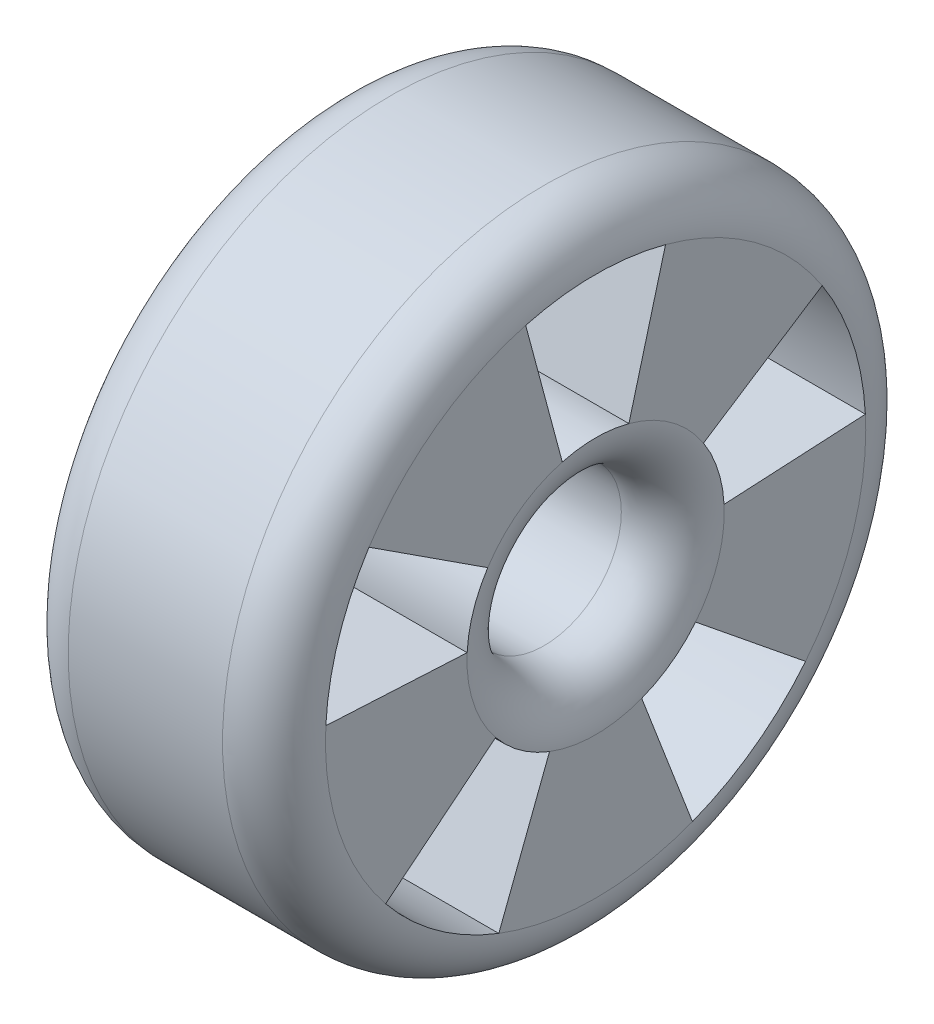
ISO-10303-21;
HEADER;
FILE_DESCRIPTION(('STEP AP214'),'2;1');
FILE_NAME('part.step','',(''),(''),'','','');
FILE_SCHEMA(('AUTOMOTIVE_DESIGN { 1 0 10303 214 1 1 1 1 }'));
ENDSEC;
DATA;
#1=APPLICATION_CONTEXT('core data for automotive mechanical design processes');
#2=APPLICATION_PROTOCOL_DEFINITION('international standard','automotive_design',2000,#1);
#3=PRODUCT_CONTEXT('',#1,'mechanical');
#4=PRODUCT('Part','Part','',(#3));
#5=PRODUCT_RELATED_PRODUCT_CATEGORY('part','',(#4));
#6=PRODUCT_DEFINITION_FORMATION('','',#4);
#7=PRODUCT_DEFINITION_CONTEXT('part definition',#1,'design');
#8=PRODUCT_DEFINITION('design','',#6,#7);
#9=PRODUCT_DEFINITION_SHAPE('','',#8);
#10=(LENGTH_UNIT() NAMED_UNIT(*) SI_UNIT(.MILLI.,.METRE.));
#11=(NAMED_UNIT(*) PLANE_ANGLE_UNIT() SI_UNIT($,.RADIAN.));
#12=(NAMED_UNIT(*) SI_UNIT($,.STERADIAN.) SOLID_ANGLE_UNIT());
#13=UNCERTAINTY_MEASURE_WITH_UNIT(LENGTH_MEASURE(1.E-05),#10,'distance_accuracy_value','');
#14=(GEOMETRIC_REPRESENTATION_CONTEXT(3) GLOBAL_UNCERTAINTY_ASSIGNED_CONTEXT((#13)) GLOBAL_UNIT_ASSIGNED_CONTEXT((#10,
#11,#12)) REPRESENTATION_CONTEXT('',''));
#15=CARTESIAN_POINT('',(0.,0.,0.));
#16=DIRECTION('',(0.,0.,1.));
#17=DIRECTION('',(1.,0.,0.));
#18=AXIS2_PLACEMENT_3D('',#15,#16,#17);
#19=CARTESIAN_POINT('',(10.,0.,0.));
#20=DIRECTION('',(1.,0.,0.));
#21=DIRECTION('',(0.,0.,-1.));
#22=AXIS2_PLACEMENT_3D('',#19,#20,#21);
#23=PLANE('',#22);
#24=DIRECTION('',(0.,-0.544639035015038,0.838670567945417));
#25=VECTOR('',#24,1.);
#26=CARTESIAN_POINT('',(10.,5.71870986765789,-8.80604096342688));
#27=LINE('',#26,#25);
#28=CARTESIAN_POINT('',(10.,5.71870986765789,-8.80604096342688));
#29=VERTEX_POINT('',#28);
#30=CARTESIAN_POINT('',(10.,2.72319517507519,-4.19335283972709));
#31=VERTEX_POINT('',#30);
#32=EDGE_CURVE('E196',#29,#31,#27,.T.);
#33=ORIENTED_EDGE('',*,*,#32,.F.);
#34=CARTESIAN_POINT('',(10.,0.,0.));
#35=DIRECTION('',(1.,0.,0.));
#36=DIRECTION('',(0.,0.,-1.));
#37=AXIS2_PLACEMENT_3D('',#34,#35,#36);
#38=CIRCLE('',#37,10.5);
#39=CARTESIAN_POINT('',(10.,10.1422211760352,-2.71759997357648));
#40=VERTEX_POINT('',#39);
#41=EDGE_CURVE('E219',#29,#40,#38,.T.);
#42=ORIENTED_EDGE('',*,*,#41,.T.);
#43=DIRECTION('',(0.,0.965925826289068,-0.258819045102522));
#44=VECTOR('',#43,1.);
#45=CARTESIAN_POINT('',(10.,10.1422211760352,-2.71759997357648));
#46=LINE('',#45,#44);
#47=CARTESIAN_POINT('',(10.,4.82962913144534,-1.29409522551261));
#48=VERTEX_POINT('',#47);
#49=EDGE_CURVE('E263',#48,#40,#46,.T.);
#50=ORIENTED_EDGE('',*,*,#49,.F.);
#51=CARTESIAN_POINT('',(10.,0.,0.));
#52=DIRECTION('',(1.,0.,0.));
#53=DIRECTION('',(0.,0.,-1.));
#54=AXIS2_PLACEMENT_3D('',#51,#52,#53);
#55=CIRCLE('',#54,5.);
#56=EDGE_CURVE('E227',#48,#31,#55,.F.);
#57=ORIENTED_EDGE('',*,*,#56,.T.);
#58=EDGE_LOOP('',(#33,#42,#50,#57));
#59=FACE_BOUND('',#58,.T.);
#60=ADVANCED_FACE('F33',(#59),#23,.T.);
#61=CARTESIAN_POINT('',(0.,0.,0.));
#62=DIRECTION('',(1.,0.,0.));
#63=DIRECTION('',(0.,0.,-1.));
#64=AXIS2_PLACEMENT_3D('',#61,#62,#63);
#65=PLANE('',#64);
#66=CARTESIAN_POINT('',(0.,0.,0.));
#67=DIRECTION('',(1.,0.,0.));
#68=DIRECTION('',(0.,0.,-1.));
#69=AXIS2_PLACEMENT_3D('',#66,#67,#68);
#70=CIRCLE('',#69,10.5);
#71=CARTESIAN_POINT('',(0.,10.1422211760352,-2.71759997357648));
#72=VERTEX_POINT('',#71);
#73=CARTESIAN_POINT('',(0.,5.71870986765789,-8.80604096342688));
#74=VERTEX_POINT('',#73);
#75=EDGE_CURVE('E400',#72,#74,#70,.F.);
#76=ORIENTED_EDGE('',*,*,#75,.T.);
#77=DIRECTION('',(0.,-0.544639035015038,0.838670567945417));
#78=VECTOR('',#77,1.);
#79=CARTESIAN_POINT('',(0.,5.71870986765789,-8.80604096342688));
#80=LINE('',#79,#78);
#81=CARTESIAN_POINT('',(0.,2.72319517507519,-4.19335283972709));
#82=VERTEX_POINT('',#81);
#83=EDGE_CURVE('E48',#74,#82,#80,.T.);
#84=ORIENTED_EDGE('',*,*,#83,.T.);
#85=CARTESIAN_POINT('',(0.,0.,0.));
#86=DIRECTION('',(1.,0.,0.));
#87=DIRECTION('',(0.,0.,-1.));
#88=AXIS2_PLACEMENT_3D('',#85,#86,#87);
#89=CIRCLE('',#88,5.);
#90=CARTESIAN_POINT('',(0.,4.82962913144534,-1.29409522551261));
#91=VERTEX_POINT('',#90);
#92=EDGE_CURVE('E195',#82,#91,#89,.T.);
#93=ORIENTED_EDGE('',*,*,#92,.T.);
#94=DIRECTION('',(0.,0.965925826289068,-0.258819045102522));
#95=VECTOR('',#94,1.);
#96=CARTESIAN_POINT('',(0.,10.1422211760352,-2.71759997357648));
#97=LINE('',#96,#95);
#98=EDGE_CURVE('E262',#91,#72,#97,.T.);
#99=ORIENTED_EDGE('',*,*,#98,.T.);
#100=EDGE_LOOP('',(#76,#84,#93,#99));
#101=FACE_BOUND('',#100,.T.);
#102=ADVANCED_FACE('F404',(#101),#65,.F.);
#103=DIRECTION('',(0.,0.052335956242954,-0.998629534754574));
#104=VECTOR('',#103,1.);
#105=CARTESIAN_POINT('',(10.,0.549527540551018,-10.485610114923));
#106=LINE('',#105,#104);
#107=CARTESIAN_POINT('',(10.,0.261679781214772,-4.99314767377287));
#108=VERTEX_POINT('',#107);
#109=CARTESIAN_POINT('',(10.,0.549527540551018,-10.485610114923));
#110=VERTEX_POINT('',#109);
#111=EDGE_CURVE('E56',#108,#110,#106,.T.);
#112=ORIENTED_EDGE('',*,*,#111,.F.);
#113=CARTESIAN_POINT('',(10.,-3.14660195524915,-3.88572980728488));
#114=VERTEX_POINT('',#113);
#115=EDGE_CURVE('E228',#108,#114,#55,.F.);
#116=ORIENTED_EDGE('',*,*,#115,.T.);
#117=DIRECTION('',(0.,0.62932039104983,0.777145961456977));
#118=VECTOR('',#117,1.);
#119=CARTESIAN_POINT('',(10.,-6.60786410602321,-8.16003259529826));
#120=LINE('',#119,#118);
#121=CARTESIAN_POINT('',(10.,-6.60786410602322,-8.16003259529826));
#122=VERTEX_POINT('',#121);
#123=EDGE_CURVE('E362',#122,#114,#120,.T.);
#124=ORIENTED_EDGE('',*,*,#123,.F.);
#125=EDGE_CURVE('E488',#122,#110,#38,.T.);
#126=ORIENTED_EDGE('',*,*,#125,.T.);
#127=EDGE_LOOP('',(#112,#116,#124,#126));
#128=FACE_BOUND('',#127,.T.);
#129=ADVANCED_FACE('F487',(#128),#23,.T.);
#130=CARTESIAN_POINT('',(0.,-3.14660195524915,-3.88572980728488));
#131=VERTEX_POINT('',#130);
#132=CARTESIAN_POINT('',(0.,0.261679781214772,-4.99314767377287));
#133=VERTEX_POINT('',#132);
#134=EDGE_CURVE('E194',#131,#133,#89,.T.);
#135=ORIENTED_EDGE('',*,*,#134,.T.);
#136=DIRECTION('',(0.,0.052335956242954,-0.998629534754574));
#137=VECTOR('',#136,1.);
#138=CARTESIAN_POINT('',(0.,0.549527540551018,-10.485610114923));
#139=LINE('',#138,#137);
#140=CARTESIAN_POINT('',(0.,0.549527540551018,-10.485610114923));
#141=VERTEX_POINT('',#140);
#142=EDGE_CURVE('E180',#133,#141,#139,.T.);
#143=ORIENTED_EDGE('',*,*,#142,.T.);
#144=CARTESIAN_POINT('',(0.,-6.60786410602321,-8.16003259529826));
#145=VERTEX_POINT('',#144);
#146=EDGE_CURVE('E401',#141,#145,#70,.F.);
#147=ORIENTED_EDGE('',*,*,#146,.T.);
#148=DIRECTION('',(0.,0.62932039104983,0.777145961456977));
#149=VECTOR('',#148,1.);
#150=CARTESIAN_POINT('',(0.,-6.60786410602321,-8.16003259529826));
#151=LINE('',#150,#149);
#152=EDGE_CURVE('E201',#145,#131,#151,.T.);
#153=ORIENTED_EDGE('',*,*,#152,.T.);
#154=EDGE_LOOP('',(#135,#143,#147,#153));
#155=FACE_BOUND('',#154,.T.);
#156=ADVANCED_FACE('F199',(#155),#65,.F.);
#157=DIRECTION('',(0.,-0.933580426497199,-0.358367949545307));
#158=VECTOR('',#157,1.);
#159=CARTESIAN_POINT('',(10.,-9.80259447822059,-3.76286347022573));
#160=LINE('',#159,#158);
#161=CARTESIAN_POINT('',(10.,-4.667902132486,-1.79183974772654));
#162=VERTEX_POINT('',#161);
#163=CARTESIAN_POINT('',(10.,-9.80259447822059,-3.76286347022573));
#164=VERTEX_POINT('',#163);
#165=EDGE_CURVE('E369',#162,#164,#160,.T.);
#166=ORIENTED_EDGE('',*,*,#165,.F.);
#167=CARTESIAN_POINT('',(10.,-4.66790213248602,1.79183974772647));
#168=VERTEX_POINT('',#167);
#169=EDGE_CURVE('E454',#162,#168,#55,.F.);
#170=ORIENTED_EDGE('',*,*,#169,.T.);
#171=DIRECTION('',(0.,0.933580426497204,-0.358367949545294));
#172=VECTOR('',#171,1.);
#173=CARTESIAN_POINT('',(10.,-9.80259447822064,3.76286347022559));
#174=LINE('',#173,#172);
#175=CARTESIAN_POINT('',(10.,-9.80259447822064,3.76286347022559));
#176=VERTEX_POINT('',#175);
#177=EDGE_CURVE('E330',#176,#168,#174,.T.);
#178=ORIENTED_EDGE('',*,*,#177,.F.);
#179=EDGE_CURVE('E489',#176,#164,#38,.T.);
#180=ORIENTED_EDGE('',*,*,#179,.T.);
#181=EDGE_LOOP('',(#166,#170,#178,#180));
#182=FACE_BOUND('',#181,.T.);
#183=ADVANCED_FACE('F465',(#182),#23,.T.);
#184=CARTESIAN_POINT('',(0.,-4.66790213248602,1.79183974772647));
#185=VERTEX_POINT('',#184);
#186=CARTESIAN_POINT('',(0.,-4.667902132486,-1.79183974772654));
#187=VERTEX_POINT('',#186);
#188=EDGE_CURVE('E202',#185,#187,#89,.T.);
#189=ORIENTED_EDGE('',*,*,#188,.T.);
#190=DIRECTION('',(0.,-0.933580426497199,-0.358367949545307));
#191=VECTOR('',#190,1.);
#192=CARTESIAN_POINT('',(0.,-9.80259447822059,-3.76286347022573));
#193=LINE('',#192,#191);
#194=CARTESIAN_POINT('',(0.,-9.80259447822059,-3.76286347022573));
#195=VERTEX_POINT('',#194);
#196=EDGE_CURVE('E379',#187,#195,#193,.T.);
#197=ORIENTED_EDGE('',*,*,#196,.T.);
#198=CARTESIAN_POINT('',(0.,-9.80259447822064,3.76286347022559));
#199=VERTEX_POINT('',#198);
#200=EDGE_CURVE('E405',#195,#199,#70,.F.);
#201=ORIENTED_EDGE('',*,*,#200,.T.);
#202=DIRECTION('',(0.,0.933580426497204,-0.358367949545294));
#203=VECTOR('',#202,1.);
#204=CARTESIAN_POINT('',(0.,-9.80259447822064,3.76286347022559));
#205=LINE('',#204,#203);
#206=EDGE_CURVE('E323',#199,#185,#205,.T.);
#207=ORIENTED_EDGE('',*,*,#206,.T.);
#208=EDGE_LOOP('',(#189,#197,#201,#207));
#209=FACE_BOUND('',#208,.T.);
#210=ADVANCED_FACE('F414',(#209),#65,.F.);
#211=DIRECTION('',(0.,-0.629320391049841,0.777145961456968));
#212=VECTOR('',#211,1.);
#213=CARTESIAN_POINT('',(10.,-6.60786410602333,8.16003259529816));
#214=LINE('',#213,#212);
#215=CARTESIAN_POINT('',(10.,-3.14660195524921,3.88572980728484));
#216=VERTEX_POINT('',#215);
#217=CARTESIAN_POINT('',(10.,-6.60786410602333,8.16003259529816));
#218=VERTEX_POINT('',#217);
#219=EDGE_CURVE('E337',#216,#218,#214,.T.);
#220=ORIENTED_EDGE('',*,*,#219,.F.);
#221=CARTESIAN_POINT('',(10.,0.261679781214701,4.99314767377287));
#222=VERTEX_POINT('',#221);
#223=EDGE_CURVE('E452',#216,#222,#55,.F.);
#224=ORIENTED_EDGE('',*,*,#223,.T.);
#225=DIRECTION('',(0.,-0.0523359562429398,-0.998629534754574));
#226=VECTOR('',#225,1.);
#227=CARTESIAN_POINT('',(10.,0.54952754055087,10.485610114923));
#228=LINE('',#227,#226);
#229=CARTESIAN_POINT('',(10.,0.549527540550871,10.485610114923));
#230=VERTEX_POINT('',#229);
#231=EDGE_CURVE('E297',#230,#222,#228,.T.);
#232=ORIENTED_EDGE('',*,*,#231,.F.);
#233=EDGE_CURVE('E490',#230,#218,#38,.T.);
#234=ORIENTED_EDGE('',*,*,#233,.T.);
#235=EDGE_LOOP('',(#220,#224,#232,#234));
#236=FACE_BOUND('',#235,.T.);
#237=ADVANCED_FACE('F512',(#236),#23,.T.);
#238=CARTESIAN_POINT('',(0.,0.261679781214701,4.99314767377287));
#239=VERTEX_POINT('',#238);
#240=CARTESIAN_POINT('',(0.,-3.14660195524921,3.88572980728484));
#241=VERTEX_POINT('',#240);
#242=EDGE_CURVE('E205',#239,#241,#89,.T.);
#243=ORIENTED_EDGE('',*,*,#242,.T.);
#244=DIRECTION('',(0.,-0.629320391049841,0.777145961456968));
#245=VECTOR('',#244,1.);
#246=CARTESIAN_POINT('',(0.,-6.60786410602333,8.16003259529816));
#247=LINE('',#246,#245);
#248=CARTESIAN_POINT('',(0.,-6.60786410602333,8.16003259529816));
#249=VERTEX_POINT('',#248);
#250=EDGE_CURVE('E348',#241,#249,#247,.T.);
#251=ORIENTED_EDGE('',*,*,#250,.T.);
#252=CARTESIAN_POINT('',(0.,0.54952754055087,10.485610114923));
#253=VERTEX_POINT('',#252);
#254=EDGE_CURVE('E406',#249,#253,#70,.F.);
#255=ORIENTED_EDGE('',*,*,#254,.T.);
#256=DIRECTION('',(0.,-0.0523359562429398,-0.998629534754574));
#257=VECTOR('',#256,1.);
#258=CARTESIAN_POINT('',(0.,0.54952754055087,10.485610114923));
#259=LINE('',#258,#257);
#260=EDGE_CURVE('E290',#253,#239,#259,.T.);
#261=ORIENTED_EDGE('',*,*,#260,.T.);
#262=EDGE_LOOP('',(#243,#251,#255,#261));
#263=FACE_BOUND('',#262,.T.);
#264=ADVANCED_FACE('F439',(#263),#65,.F.);
#265=DIRECTION('',(0.,0.544639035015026,0.838670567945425));
#266=VECTOR('',#265,1.);
#267=CARTESIAN_POINT('',(10.,5.71870986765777,8.80604096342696));
#268=LINE('',#267,#266);
#269=CARTESIAN_POINT('',(10.,2.72319517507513,4.19335283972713));
#270=VERTEX_POINT('',#269);
#271=CARTESIAN_POINT('',(10.,5.71870986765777,8.80604096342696));
#272=VERTEX_POINT('',#271);
#273=EDGE_CURVE('E304',#270,#272,#268,.T.);
#274=ORIENTED_EDGE('',*,*,#273,.F.);
#275=CARTESIAN_POINT('',(10.,4.82962913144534,1.29409522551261));
#276=VERTEX_POINT('',#275);
#277=EDGE_CURVE('E223',#270,#276,#55,.F.);
#278=ORIENTED_EDGE('',*,*,#277,.T.);
#279=DIRECTION('',(0.,-0.965925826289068,-0.258819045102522));
#280=VECTOR('',#279,1.);
#281=CARTESIAN_POINT('',(10.,10.1422211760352,2.71759997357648));
#282=LINE('',#281,#280);
#283=CARTESIAN_POINT('',(10.,10.1422211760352,2.71759997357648));
#284=VERTEX_POINT('',#283);
#285=EDGE_CURVE('E255',#284,#276,#282,.T.);
#286=ORIENTED_EDGE('',*,*,#285,.F.);
#287=EDGE_CURVE('E224',#284,#272,#38,.T.);
#288=ORIENTED_EDGE('',*,*,#287,.T.);
#289=EDGE_LOOP('',(#274,#278,#286,#288));
#290=FACE_BOUND('',#289,.T.);
#291=ADVANCED_FACE('F257',(#290),#23,.T.);
#292=CARTESIAN_POINT('',(0.,4.82962913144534,1.29409522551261));
#293=VERTEX_POINT('',#292);
#294=CARTESIAN_POINT('',(0.,2.72319517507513,4.19335283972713));
#295=VERTEX_POINT('',#294);
#296=EDGE_CURVE('E212',#293,#295,#89,.T.);
#297=ORIENTED_EDGE('',*,*,#296,.T.);
#298=DIRECTION('',(0.,0.544639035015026,0.838670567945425));
#299=VECTOR('',#298,1.);
#300=CARTESIAN_POINT('',(0.,5.71870986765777,8.80604096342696));
#301=LINE('',#300,#299);
#302=CARTESIAN_POINT('',(0.,5.71870986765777,8.80604096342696));
#303=VERTEX_POINT('',#302);
#304=EDGE_CURVE('E315',#295,#303,#301,.T.);
#305=ORIENTED_EDGE('',*,*,#304,.T.);
#306=CARTESIAN_POINT('',(0.,10.1422211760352,2.71759997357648));
#307=VERTEX_POINT('',#306);
#308=EDGE_CURVE('E275',#303,#307,#70,.F.);
#309=ORIENTED_EDGE('',*,*,#308,.T.);
#310=DIRECTION('',(0.,-0.965925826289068,-0.258819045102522));
#311=VECTOR('',#310,1.);
#312=CARTESIAN_POINT('',(0.,10.1422211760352,2.71759997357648));
#313=LINE('',#312,#311);
#314=EDGE_CURVE('E266',#307,#293,#313,.T.);
#315=ORIENTED_EDGE('',*,*,#314,.T.);
#316=EDGE_LOOP('',(#297,#305,#309,#315));
#317=FACE_BOUND('',#316,.T.);
#318=ADVANCED_FACE('F431',(#317),#65,.F.);
#319=CARTESIAN_POINT('',(10.,0.,0.));
#320=DIRECTION('',(-1.,0.,0.));
#321=DIRECTION('',(0.,0.,1.));
#322=AXIS2_PLACEMENT_3D('',#319,#320,#321);
#323=CYLINDRICAL_SURFACE('',#322,12.5);
#324=CARTESIAN_POINT('',(2.,0.,0.));
#325=DIRECTION('',(1.,0.,0.));
#326=DIRECTION('',(0.,0.,-1.));
#327=AXIS2_PLACEMENT_3D('',#324,#325,#326);
#328=CIRCLE('',#327,12.5);
#329=CARTESIAN_POINT('',(2.,0.,-12.5));
#330=VERTEX_POINT('',#329);
#331=EDGE_CURVE('E11',#330,#330,#328,.T.);
#332=ORIENTED_EDGE('',*,*,#331,.T.);
#333=EDGE_LOOP('',(#332));
#334=FACE_BOUND('',#333,.T.);
#335=CARTESIAN_POINT('',(8.,0.,0.));
#336=DIRECTION('',(1.,0.,0.));
#337=DIRECTION('',(0.,0.,-1.));
#338=AXIS2_PLACEMENT_3D('',#335,#336,#337);
#339=CIRCLE('',#338,12.5);
#340=CARTESIAN_POINT('',(8.,0.,-12.5));
#341=VERTEX_POINT('',#340);
#342=EDGE_CURVE('E41',#341,#341,#339,.F.);
#343=ORIENTED_EDGE('',*,*,#342,.T.);
#344=EDGE_LOOP('',(#343));
#345=FACE_BOUND('',#344,.T.);
#346=ADVANCED_FACE('F232',(#334,#345),#323,.T.);
#347=CARTESIAN_POINT('',(10.,0.,0.));
#348=DIRECTION('',(-1.,0.,0.));
#349=DIRECTION('',(0.,0.,1.));
#350=AXIS2_PLACEMENT_3D('',#347,#348,#349);
#351=CYLINDRICAL_SURFACE('',#350,3.);
#352=CARTESIAN_POINT('',(2.,0.,0.));
#353=DIRECTION('',(1.,0.,0.));
#354=DIRECTION('',(0.,0.,-1.));
#355=AXIS2_PLACEMENT_3D('',#352,#353,#354);
#356=CIRCLE('',#355,3.);
#357=CARTESIAN_POINT('',(2.,0.,-3.));
#358=VERTEX_POINT('',#357);
#359=EDGE_CURVE('E216',#358,#358,#356,.F.);
#360=ORIENTED_EDGE('',*,*,#359,.T.);
#361=EDGE_LOOP('',(#360));
#362=FACE_BOUND('',#361,.T.);
#363=CARTESIAN_POINT('',(8.,0.,0.));
#364=DIRECTION('',(1.,0.,0.));
#365=DIRECTION('',(0.,0.,-1.));
#366=AXIS2_PLACEMENT_3D('',#363,#364,#365);
#367=CIRCLE('',#366,3.);
#368=CARTESIAN_POINT('',(8.,0.,-3.));
#369=VERTEX_POINT('',#368);
#370=EDGE_CURVE('E211',#369,#369,#367,.T.);
#371=ORIENTED_EDGE('',*,*,#370,.T.);
#372=EDGE_LOOP('',(#371));
#373=FACE_BOUND('',#372,.T.);
#374=ADVANCED_FACE('F530',(#362,#373),#351,.F.);
#375=CARTESIAN_POINT('',(2.,0.,0.));
#376=DIRECTION('',(1.,0.,0.));
#377=DIRECTION('',(0.,0.,-1.));
#378=AXIS2_PLACEMENT_3D('',#375,#376,#377);
#379=TOROIDAL_SURFACE('',#378,5.,2.);
#380=ORIENTED_EDGE('',*,*,#359,.F.);
#381=EDGE_LOOP('',(#380));
#382=FACE_BOUND('',#381,.T.);
#383=EDGE_CURVE('E207',#91,#293,#89,.T.);
#384=ORIENTED_EDGE('',*,*,#383,.F.);
#385=ORIENTED_EDGE('',*,*,#92,.F.);
#386=CARTESIAN_POINT('',(0.,0.,0.));
#387=DIRECTION('',(-1.,0.,0.));
#388=DIRECTION('',(0.,-0.95105651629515,-0.309016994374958));
#389=AXIS2_PLACEMENT_3D('',#386,#387,#388);
#390=CIRCLE('',#389,5.);
#391=EDGE_CURVE('E174',#82,#133,#390,.T.);
#392=ORIENTED_EDGE('',*,*,#391,.T.);
#393=ORIENTED_EDGE('',*,*,#134,.F.);
#394=CARTESIAN_POINT('',(0.,0.,0.));
#395=DIRECTION('',(-1.,0.,0.));
#396=DIRECTION('',(0.,-0.58778525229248,0.809016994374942));
#397=AXIS2_PLACEMENT_3D('',#394,#395,#396);
#398=CIRCLE('',#397,5.);
#399=EDGE_CURVE('E365',#131,#187,#398,.T.);
#400=ORIENTED_EDGE('',*,*,#399,.T.);
#401=ORIENTED_EDGE('',*,*,#188,.F.);
#402=CARTESIAN_POINT('',(0.,0.,0.));
#403=DIRECTION('',(-1.,0.,0.));
#404=DIRECTION('',(0.,0.587785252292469,0.809016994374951));
#405=AXIS2_PLACEMENT_3D('',#402,#403,#404);
#406=CIRCLE('',#405,5.);
#407=EDGE_CURVE('E333',#185,#241,#406,.T.);
#408=ORIENTED_EDGE('',*,*,#407,.T.);
#409=ORIENTED_EDGE('',*,*,#242,.F.);
#410=CARTESIAN_POINT('',(0.,0.,0.));
#411=DIRECTION('',(-1.,0.,0.));
#412=DIRECTION('',(0.,0.951056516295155,-0.309016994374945));
#413=AXIS2_PLACEMENT_3D('',#410,#411,#412);
#414=CIRCLE('',#413,5.);
#415=EDGE_CURVE('E300',#239,#295,#414,.T.);
#416=ORIENTED_EDGE('',*,*,#415,.T.);
#417=ORIENTED_EDGE('',*,*,#296,.F.);
#418=EDGE_LOOP('',(#384,#385,#392,#393,#400,#401,#408,#409,#416,#417));
#419=FACE_BOUND('',#418,.T.);
#420=ADVANCED_FACE('F192',(#382,#419),#379,.T.);
#421=CARTESIAN_POINT('',(8.,0.,0.));
#422=DIRECTION('',(1.,0.,0.));
#423=DIRECTION('',(0.,0.,-1.));
#424=AXIS2_PLACEMENT_3D('',#421,#422,#423);
#425=TOROIDAL_SURFACE('',#424,5.,2.);
#426=EDGE_CURVE('E225',#276,#48,#55,.F.);
#427=ORIENTED_EDGE('',*,*,#426,.F.);
#428=ORIENTED_EDGE('',*,*,#277,.F.);
#429=CARTESIAN_POINT('',(10.,0.,0.));
#430=DIRECTION('',(-1.,0.,0.));
#431=DIRECTION('',(0.,0.951056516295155,-0.309016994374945));
#432=AXIS2_PLACEMENT_3D('',#429,#430,#431);
#433=CIRCLE('',#432,5.);
#434=EDGE_CURVE('E306',#222,#270,#433,.T.);
#435=ORIENTED_EDGE('',*,*,#434,.F.);
#436=ORIENTED_EDGE('',*,*,#223,.F.);
#437=CARTESIAN_POINT('',(10.,0.,0.));
#438=DIRECTION('',(-1.,0.,0.));
#439=DIRECTION('',(0.,0.587785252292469,0.809016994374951));
#440=AXIS2_PLACEMENT_3D('',#437,#438,#439);
#441=CIRCLE('',#440,5.);
#442=EDGE_CURVE('E339',#168,#216,#441,.T.);
#443=ORIENTED_EDGE('',*,*,#442,.F.);
#444=ORIENTED_EDGE('',*,*,#169,.F.);
#445=CARTESIAN_POINT('',(10.,0.,0.));
#446=DIRECTION('',(-1.,0.,0.));
#447=DIRECTION('',(0.,-0.58778525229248,0.809016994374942));
#448=AXIS2_PLACEMENT_3D('',#445,#446,#447);
#449=CIRCLE('',#448,5.);
#450=EDGE_CURVE('E371',#114,#162,#449,.T.);
#451=ORIENTED_EDGE('',*,*,#450,.F.);
#452=ORIENTED_EDGE('',*,*,#115,.F.);
#453=CARTESIAN_POINT('',(10.,0.,0.));
#454=DIRECTION('',(-1.,0.,0.));
#455=DIRECTION('',(0.,-0.95105651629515,-0.309016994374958));
#456=AXIS2_PLACEMENT_3D('',#453,#454,#455);
#457=CIRCLE('',#456,5.);
#458=EDGE_CURVE('E176',#31,#108,#457,.T.);
#459=ORIENTED_EDGE('',*,*,#458,.F.);
#460=ORIENTED_EDGE('',*,*,#56,.F.);
#461=EDGE_LOOP('',(#427,#428,#435,#436,#443,#444,#451,#452,#459,#460));
#462=FACE_BOUND('',#461,.T.);
#463=ORIENTED_EDGE('',*,*,#370,.F.);
#464=EDGE_LOOP('',(#463));
#465=FACE_BOUND('',#464,.T.);
#466=ADVANCED_FACE('F449',(#462,#465),#425,.T.);
#467=CARTESIAN_POINT('',(2.,0.,0.));
#468=DIRECTION('',(1.,0.,0.));
#469=DIRECTION('',(0.,0.,-1.));
#470=AXIS2_PLACEMENT_3D('',#467,#468,#469);
#471=TOROIDAL_SURFACE('',#470,10.5,2.);
#472=EDGE_CURVE('E206',#307,#72,#70,.F.);
#473=ORIENTED_EDGE('',*,*,#472,.F.);
#474=ORIENTED_EDGE('',*,*,#308,.F.);
#475=CARTESIAN_POINT('',(0.,0.,0.));
#476=DIRECTION('',(1.,0.,0.));
#477=DIRECTION('',(0.,0.951056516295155,-0.309016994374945));
#478=AXIS2_PLACEMENT_3D('',#475,#476,#477);
#479=CIRCLE('',#478,10.5);
#480=EDGE_CURVE('E312',#303,#253,#479,.T.);
#481=ORIENTED_EDGE('',*,*,#480,.T.);
#482=ORIENTED_EDGE('',*,*,#254,.F.);
#483=CARTESIAN_POINT('',(0.,0.,0.));
#484=DIRECTION('',(1.,0.,0.));
#485=DIRECTION('',(0.,0.587785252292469,0.809016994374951));
#486=AXIS2_PLACEMENT_3D('',#483,#484,#485);
#487=CIRCLE('',#486,10.5);
#488=EDGE_CURVE('E345',#249,#199,#487,.T.);
#489=ORIENTED_EDGE('',*,*,#488,.T.);
#490=ORIENTED_EDGE('',*,*,#200,.F.);
#491=CARTESIAN_POINT('',(0.,0.,0.));
#492=DIRECTION('',(1.,0.,0.));
#493=DIRECTION('',(0.,-0.58778525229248,0.809016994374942));
#494=AXIS2_PLACEMENT_3D('',#491,#492,#493);
#495=CIRCLE('',#494,10.5);
#496=EDGE_CURVE('E376',#195,#145,#495,.T.);
#497=ORIENTED_EDGE('',*,*,#496,.T.);
#498=ORIENTED_EDGE('',*,*,#146,.F.);
#499=CARTESIAN_POINT('',(0.,0.,0.));
#500=DIRECTION('',(1.,0.,0.));
#501=DIRECTION('',(0.,-0.95105651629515,-0.309016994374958));
#502=AXIS2_PLACEMENT_3D('',#499,#500,#501);
#503=CIRCLE('',#502,10.5);
#504=EDGE_CURVE('E186',#141,#74,#503,.T.);
#505=ORIENTED_EDGE('',*,*,#504,.T.);
#506=ORIENTED_EDGE('',*,*,#75,.F.);
#507=EDGE_LOOP('',(#473,#474,#481,#482,#489,#490,#497,#498,#505,#506));
#508=FACE_BOUND('',#507,.T.);
#509=ORIENTED_EDGE('',*,*,#331,.F.);
#510=EDGE_LOOP('',(#509));
#511=FACE_BOUND('',#510,.T.);
#512=ADVANCED_FACE('F237',(#508,#511),#471,.T.);
#513=CARTESIAN_POINT('',(8.,0.,0.));
#514=DIRECTION('',(1.,0.,0.));
#515=DIRECTION('',(0.,0.,-1.));
#516=AXIS2_PLACEMENT_3D('',#513,#514,#515);
#517=TOROIDAL_SURFACE('',#516,10.5,2.);
#518=ORIENTED_EDGE('',*,*,#342,.F.);
#519=EDGE_LOOP('',(#518));
#520=FACE_BOUND('',#519,.T.);
#521=EDGE_CURVE('E220',#40,#284,#38,.T.);
#522=ORIENTED_EDGE('',*,*,#521,.F.);
#523=ORIENTED_EDGE('',*,*,#41,.F.);
#524=CARTESIAN_POINT('',(10.,0.,0.));
#525=DIRECTION('',(1.,0.,0.));
#526=DIRECTION('',(0.,-0.95105651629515,-0.309016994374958));
#527=AXIS2_PLACEMENT_3D('',#524,#525,#526);
#528=CIRCLE('',#527,10.5);
#529=EDGE_CURVE('E389',#110,#29,#528,.T.);
#530=ORIENTED_EDGE('',*,*,#529,.F.);
#531=ORIENTED_EDGE('',*,*,#125,.F.);
#532=CARTESIAN_POINT('',(10.,0.,0.));
#533=DIRECTION('',(1.,0.,0.));
#534=DIRECTION('',(0.,-0.58778525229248,0.809016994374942));
#535=AXIS2_PLACEMENT_3D('',#532,#533,#534);
#536=CIRCLE('',#535,10.5);
#537=EDGE_CURVE('E366',#164,#122,#536,.T.);
#538=ORIENTED_EDGE('',*,*,#537,.F.);
#539=ORIENTED_EDGE('',*,*,#179,.F.);
#540=CARTESIAN_POINT('',(10.,0.,0.));
#541=DIRECTION('',(1.,0.,0.));
#542=DIRECTION('',(0.,0.587785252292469,0.809016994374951));
#543=AXIS2_PLACEMENT_3D('',#540,#541,#542);
#544=CIRCLE('',#543,10.5);
#545=EDGE_CURVE('E334',#218,#176,#544,.T.);
#546=ORIENTED_EDGE('',*,*,#545,.F.);
#547=ORIENTED_EDGE('',*,*,#233,.F.);
#548=CARTESIAN_POINT('',(10.,0.,0.));
#549=DIRECTION('',(1.,0.,0.));
#550=DIRECTION('',(0.,0.951056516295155,-0.309016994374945));
#551=AXIS2_PLACEMENT_3D('',#548,#549,#550);
#552=CIRCLE('',#551,10.5);
#553=EDGE_CURVE('E301',#272,#230,#552,.T.);
#554=ORIENTED_EDGE('',*,*,#553,.F.);
#555=ORIENTED_EDGE('',*,*,#287,.F.);
#556=EDGE_LOOP('',(#522,#523,#530,#531,#538,#539,#546,#547,#554,#555));
#557=FACE_BOUND('',#556,.T.);
#558=ADVANCED_FACE('F35',(#520,#557),#517,.T.);
#559=CARTESIAN_POINT('',(0.,0.,0.));
#560=DIRECTION('',(1.,0.,0.));
#561=DIRECTION('',(0.,0.,-1.));
#562=AXIS2_PLACEMENT_3D('',#559,#560,#561);
#563=CYLINDRICAL_SURFACE('',#562,5.);
#564=ORIENTED_EDGE('',*,*,#426,.T.);
#565=DIRECTION('',(1.,0.,0.));
#566=VECTOR('',#565,1.);
#567=CARTESIAN_POINT('',(0.,4.82962913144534,-1.29409522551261));
#568=LINE('',#567,#566);
#569=EDGE_CURVE('E277',#91,#48,#568,.T.);
#570=ORIENTED_EDGE('',*,*,#569,.F.);
#571=ORIENTED_EDGE('',*,*,#383,.T.);
#572=DIRECTION('',(1.,0.,0.));
#573=VECTOR('',#572,1.);
#574=CARTESIAN_POINT('',(0.,4.82962913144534,1.29409522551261));
#575=LINE('',#574,#573);
#576=EDGE_CURVE('E273',#293,#276,#575,.T.);
#577=ORIENTED_EDGE('',*,*,#576,.T.);
#578=EDGE_LOOP('',(#564,#570,#571,#577));
#579=FACE_BOUND('',#578,.T.);
#580=ADVANCED_FACE('F236',(#579),#563,.T.);
#581=CARTESIAN_POINT('',(0.,10.1422211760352,2.71759997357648));
#582=DIRECTION('',(0.,-0.258819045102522,0.965925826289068));
#583=DIRECTION('',(0.,-0.965925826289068,-0.258819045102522));
#584=AXIS2_PLACEMENT_3D('',#581,#582,#583);
#585=PLANE('',#584);
#586=ORIENTED_EDGE('',*,*,#285,.T.);
#587=ORIENTED_EDGE('',*,*,#576,.F.);
#588=ORIENTED_EDGE('',*,*,#314,.F.);
#589=DIRECTION('',(1.,0.,0.));
#590=VECTOR('',#589,1.);
#591=CARTESIAN_POINT('',(0.,10.1422211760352,2.71759997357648));
#592=LINE('',#591,#590);
#593=EDGE_CURVE('E250',#307,#284,#592,.T.);
#594=ORIENTED_EDGE('',*,*,#593,.T.);
#595=EDGE_LOOP('',(#586,#587,#588,#594));
#596=FACE_BOUND('',#595,.T.);
#597=ADVANCED_FACE('F493',(#596),#585,.F.);
#598=CARTESIAN_POINT('',(0.,0.,0.));
#599=DIRECTION('',(1.,0.,0.));
#600=DIRECTION('',(0.,0.,-1.));
#601=AXIS2_PLACEMENT_3D('',#598,#599,#600);
#602=CYLINDRICAL_SURFACE('',#601,10.5);
#603=ORIENTED_EDGE('',*,*,#521,.T.);
#604=ORIENTED_EDGE('',*,*,#593,.F.);
#605=ORIENTED_EDGE('',*,*,#472,.T.);
#606=DIRECTION('',(1.,0.,0.));
#607=VECTOR('',#606,1.);
#608=CARTESIAN_POINT('',(0.,10.1422211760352,-2.71759997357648));
#609=LINE('',#608,#607);
#610=EDGE_CURVE('E252',#72,#40,#609,.T.);
#611=ORIENTED_EDGE('',*,*,#610,.T.);
#612=EDGE_LOOP('',(#603,#604,#605,#611));
#613=FACE_BOUND('',#612,.T.);
#614=ADVANCED_FACE('F248',(#613),#602,.F.);
#615=CARTESIAN_POINT('',(0.,10.1422211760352,-2.71759997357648));
#616=DIRECTION('',(0.,-0.258819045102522,-0.965925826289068));
#617=DIRECTION('',(0.,0.965925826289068,-0.258819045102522));
#618=AXIS2_PLACEMENT_3D('',#615,#616,#617);
#619=PLANE('',#618);
#620=ORIENTED_EDGE('',*,*,#49,.T.);
#621=ORIENTED_EDGE('',*,*,#610,.F.);
#622=ORIENTED_EDGE('',*,*,#98,.F.);
#623=ORIENTED_EDGE('',*,*,#569,.T.);
#624=EDGE_LOOP('',(#620,#621,#622,#623));
#625=FACE_BOUND('',#624,.T.);
#626=ADVANCED_FACE('F491',(#625),#619,.F.);
#627=CARTESIAN_POINT('',(0.,0.,0.));
#628=DIRECTION('',(1.,0.,0.));
#629=DIRECTION('',(0.,0.,-1.));
#630=AXIS2_PLACEMENT_3D('',#627,#628,#629);
#631=CYLINDRICAL_SURFACE('',#630,5.);
#632=ORIENTED_EDGE('',*,*,#434,.T.);
#633=DIRECTION('',(1.,0.,0.));
#634=VECTOR('',#633,1.);
#635=CARTESIAN_POINT('',(0.,2.72319517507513,4.19335283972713));
#636=LINE('',#635,#634);
#637=EDGE_CURVE('E287',#295,#270,#636,.T.);
#638=ORIENTED_EDGE('',*,*,#637,.F.);
#639=ORIENTED_EDGE('',*,*,#415,.F.);
#640=DIRECTION('',(1.,0.,0.));
#641=VECTOR('',#640,1.);
#642=CARTESIAN_POINT('',(0.,0.261679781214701,4.99314767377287));
#643=LINE('',#642,#641);
#644=EDGE_CURVE('E269',#239,#222,#643,.T.);
#645=ORIENTED_EDGE('',*,*,#644,.T.);
#646=EDGE_LOOP('',(#632,#638,#639,#645));
#647=FACE_BOUND('',#646,.T.);
#648=ADVANCED_FACE('F438',(#647),#631,.T.);
#649=CARTESIAN_POINT('',(0.,0.54952754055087,10.485610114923));
#650=DIRECTION('',(0.,-0.998629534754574,0.0523359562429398));
#651=DIRECTION('',(0.,-0.0523359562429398,-0.998629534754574));
#652=AXIS2_PLACEMENT_3D('',#649,#650,#651);
#653=PLANE('',#652);
#654=ORIENTED_EDGE('',*,*,#231,.T.);
#655=ORIENTED_EDGE('',*,*,#644,.F.);
#656=ORIENTED_EDGE('',*,*,#260,.F.);
#657=DIRECTION('',(1.,0.,0.));
#658=VECTOR('',#657,1.);
#659=CARTESIAN_POINT('',(0.,0.549527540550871,10.485610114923));
#660=LINE('',#659,#658);
#661=EDGE_CURVE('E293',#253,#230,#660,.T.);
#662=ORIENTED_EDGE('',*,*,#661,.T.);
#663=EDGE_LOOP('',(#654,#655,#656,#662));
#664=FACE_BOUND('',#663,.T.);
#665=ADVANCED_FACE('F441',(#664),#653,.F.);
#666=CARTESIAN_POINT('',(0.,0.,0.));
#667=DIRECTION('',(1.,0.,0.));
#668=DIRECTION('',(0.,0.,-1.));
#669=AXIS2_PLACEMENT_3D('',#666,#667,#668);
#670=CYLINDRICAL_SURFACE('',#669,10.5);
#671=ORIENTED_EDGE('',*,*,#553,.T.);
#672=ORIENTED_EDGE('',*,*,#661,.F.);
#673=ORIENTED_EDGE('',*,*,#480,.F.);
#674=DIRECTION('',(1.,0.,0.));
#675=VECTOR('',#674,1.);
#676=CARTESIAN_POINT('',(0.,5.71870986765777,8.80604096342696));
#677=LINE('',#676,#675);
#678=EDGE_CURVE('E289',#303,#272,#677,.T.);
#679=ORIENTED_EDGE('',*,*,#678,.T.);
#680=EDGE_LOOP('',(#671,#672,#673,#679));
#681=FACE_BOUND('',#680,.T.);
#682=ADVANCED_FACE('F429',(#681),#670,.F.);
#683=CARTESIAN_POINT('',(0.,5.71870986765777,8.80604096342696));
#684=DIRECTION('',(0.,0.838670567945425,-0.544639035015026));
#685=DIRECTION('',(0.,0.544639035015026,0.838670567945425));
#686=AXIS2_PLACEMENT_3D('',#683,#684,#685);
#687=PLANE('',#686);
#688=ORIENTED_EDGE('',*,*,#273,.T.);
#689=ORIENTED_EDGE('',*,*,#678,.F.);
#690=ORIENTED_EDGE('',*,*,#304,.F.);
#691=ORIENTED_EDGE('',*,*,#637,.T.);
#692=EDGE_LOOP('',(#688,#689,#690,#691));
#693=FACE_BOUND('',#692,.T.);
#694=ADVANCED_FACE('F433',(#693),#687,.F.);
#695=CARTESIAN_POINT('',(0.,0.,0.));
#696=DIRECTION('',(1.,0.,0.));
#697=DIRECTION('',(0.,0.,-1.));
#698=AXIS2_PLACEMENT_3D('',#695,#696,#697);
#699=CYLINDRICAL_SURFACE('',#698,5.);
#700=ORIENTED_EDGE('',*,*,#442,.T.);
#701=DIRECTION('',(1.,0.,0.));
#702=VECTOR('',#701,1.);
#703=CARTESIAN_POINT('',(0.,-3.14660195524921,3.88572980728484));
#704=LINE('',#703,#702);
#705=EDGE_CURVE('E320',#241,#216,#704,.T.);
#706=ORIENTED_EDGE('',*,*,#705,.F.);
#707=ORIENTED_EDGE('',*,*,#407,.F.);
#708=DIRECTION('',(1.,0.,0.));
#709=VECTOR('',#708,1.);
#710=CARTESIAN_POINT('',(0.,-4.66790213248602,1.79183974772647));
#711=LINE('',#710,#709);
#712=EDGE_CURVE('E309',#185,#168,#711,.T.);
#713=ORIENTED_EDGE('',*,*,#712,.T.);
#714=EDGE_LOOP('',(#700,#706,#707,#713));
#715=FACE_BOUND('',#714,.T.);
#716=ADVANCED_FACE('F470',(#715),#699,.T.);
#717=CARTESIAN_POINT('',(0.,-9.80259447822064,3.76286347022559));
#718=DIRECTION('',(0.,-0.358367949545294,-0.933580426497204));
#719=DIRECTION('',(0.,0.933580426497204,-0.358367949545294));
#720=AXIS2_PLACEMENT_3D('',#717,#718,#719);
#721=PLANE('',#720);
#722=ORIENTED_EDGE('',*,*,#177,.T.);
#723=ORIENTED_EDGE('',*,*,#712,.F.);
#724=ORIENTED_EDGE('',*,*,#206,.F.);
#725=DIRECTION('',(1.,0.,0.));
#726=VECTOR('',#725,1.);
#727=CARTESIAN_POINT('',(0.,-9.80259447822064,3.76286347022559));
#728=LINE('',#727,#726);
#729=EDGE_CURVE('E326',#199,#176,#728,.T.);
#730=ORIENTED_EDGE('',*,*,#729,.T.);
#731=EDGE_LOOP('',(#722,#723,#724,#730));
#732=FACE_BOUND('',#731,.T.);
#733=ADVANCED_FACE('F419',(#732),#721,.F.);
#734=CARTESIAN_POINT('',(0.,0.,0.));
#735=DIRECTION('',(1.,0.,0.));
#736=DIRECTION('',(0.,0.,-1.));
#737=AXIS2_PLACEMENT_3D('',#734,#735,#736);
#738=CYLINDRICAL_SURFACE('',#737,10.5);
#739=ORIENTED_EDGE('',*,*,#545,.T.);
#740=ORIENTED_EDGE('',*,*,#729,.F.);
#741=ORIENTED_EDGE('',*,*,#488,.F.);
#742=DIRECTION('',(1.,0.,0.));
#743=VECTOR('',#742,1.);
#744=CARTESIAN_POINT('',(0.,-6.60786410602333,8.16003259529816));
#745=LINE('',#744,#743);
#746=EDGE_CURVE('E322',#249,#218,#745,.T.);
#747=ORIENTED_EDGE('',*,*,#746,.T.);
#748=EDGE_LOOP('',(#739,#740,#741,#747));
#749=FACE_BOUND('',#748,.T.);
#750=ADVANCED_FACE('F423',(#749),#738,.F.);
#751=CARTESIAN_POINT('',(0.,-6.60786410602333,8.16003259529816));
#752=DIRECTION('',(0.,0.777145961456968,0.629320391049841));
#753=DIRECTION('',(0.,-0.629320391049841,0.777145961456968));
#754=AXIS2_PLACEMENT_3D('',#751,#752,#753);
#755=PLANE('',#754);
#756=ORIENTED_EDGE('',*,*,#219,.T.);
#757=ORIENTED_EDGE('',*,*,#746,.F.);
#758=ORIENTED_EDGE('',*,*,#250,.F.);
#759=ORIENTED_EDGE('',*,*,#705,.T.);
#760=EDGE_LOOP('',(#756,#757,#758,#759));
#761=FACE_BOUND('',#760,.T.);
#762=ADVANCED_FACE('F699',(#761),#755,.F.);
#763=CARTESIAN_POINT('',(0.,0.,0.));
#764=DIRECTION('',(1.,0.,0.));
#765=DIRECTION('',(0.,0.,-1.));
#766=AXIS2_PLACEMENT_3D('',#763,#764,#765);
#767=CYLINDRICAL_SURFACE('',#766,5.);
#768=ORIENTED_EDGE('',*,*,#450,.T.);
#769=DIRECTION('',(1.,0.,0.));
#770=VECTOR('',#769,1.);
#771=CARTESIAN_POINT('',(0.,-4.667902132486,-1.79183974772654));
#772=LINE('',#771,#770);
#773=EDGE_CURVE('E353',#187,#162,#772,.T.);
#774=ORIENTED_EDGE('',*,*,#773,.F.);
#775=ORIENTED_EDGE('',*,*,#399,.F.);
#776=DIRECTION('',(1.,0.,0.));
#777=VECTOR('',#776,1.);
#778=CARTESIAN_POINT('',(0.,-3.14660195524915,-3.88572980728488));
#779=LINE('',#778,#777);
#780=EDGE_CURVE('E342',#131,#114,#779,.T.);
#781=ORIENTED_EDGE('',*,*,#780,.T.);
#782=EDGE_LOOP('',(#768,#774,#775,#781));
#783=FACE_BOUND('',#782,.T.);
#784=ADVANCED_FACE('F475',(#783),#767,.T.);
#785=CARTESIAN_POINT('',(0.,-6.60786410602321,-8.16003259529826));
#786=DIRECTION('',(0.,0.777145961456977,-0.62932039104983));
#787=DIRECTION('',(0.,0.62932039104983,0.777145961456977));
#788=AXIS2_PLACEMENT_3D('',#785,#786,#787);
#789=PLANE('',#788);
#790=ORIENTED_EDGE('',*,*,#123,.T.);
#791=ORIENTED_EDGE('',*,*,#780,.F.);
#792=ORIENTED_EDGE('',*,*,#152,.F.);
#793=DIRECTION('',(1.,0.,0.));
#794=VECTOR('',#793,1.);
#795=CARTESIAN_POINT('',(0.,-6.60786410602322,-8.16003259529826));
#796=LINE('',#795,#794);
#797=EDGE_CURVE('E358',#145,#122,#796,.T.);
#798=ORIENTED_EDGE('',*,*,#797,.T.);
#799=EDGE_LOOP('',(#790,#791,#792,#798));
#800=FACE_BOUND('',#799,.T.);
#801=ADVANCED_FACE('F484',(#800),#789,.F.);
#802=CARTESIAN_POINT('',(0.,0.,0.));
#803=DIRECTION('',(1.,0.,0.));
#804=DIRECTION('',(0.,0.,-1.));
#805=AXIS2_PLACEMENT_3D('',#802,#803,#804);
#806=CYLINDRICAL_SURFACE('',#805,10.5);
#807=ORIENTED_EDGE('',*,*,#537,.T.);
#808=ORIENTED_EDGE('',*,*,#797,.F.);
#809=ORIENTED_EDGE('',*,*,#496,.F.);
#810=DIRECTION('',(1.,0.,0.));
#811=VECTOR('',#810,1.);
#812=CARTESIAN_POINT('',(0.,-9.80259447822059,-3.76286347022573));
#813=LINE('',#812,#811);
#814=EDGE_CURVE('E355',#195,#164,#813,.T.);
#815=ORIENTED_EDGE('',*,*,#814,.T.);
#816=EDGE_LOOP('',(#807,#808,#809,#815));
#817=FACE_BOUND('',#816,.T.);
#818=ADVANCED_FACE('F482',(#817),#806,.F.);
#819=CARTESIAN_POINT('',(0.,-9.80259447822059,-3.76286347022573));
#820=DIRECTION('',(0.,-0.358367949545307,0.933580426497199));
#821=DIRECTION('',(0.,-0.933580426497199,-0.358367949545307));
#822=AXIS2_PLACEMENT_3D('',#819,#820,#821);
#823=PLANE('',#822);
#824=ORIENTED_EDGE('',*,*,#165,.T.);
#825=ORIENTED_EDGE('',*,*,#814,.F.);
#826=ORIENTED_EDGE('',*,*,#196,.F.);
#827=ORIENTED_EDGE('',*,*,#773,.T.);
#828=EDGE_LOOP('',(#824,#825,#826,#827));
#829=FACE_BOUND('',#828,.T.);
#830=ADVANCED_FACE('F477',(#829),#823,.F.);
#831=CARTESIAN_POINT('',(0.,0.,0.));
#832=DIRECTION('',(1.,0.,0.));
#833=DIRECTION('',(0.,0.,-1.));
#834=AXIS2_PLACEMENT_3D('',#831,#832,#833);
#835=CYLINDRICAL_SURFACE('',#834,5.);
#836=ORIENTED_EDGE('',*,*,#458,.T.);
#837=DIRECTION('',(1.,0.,0.));
#838=VECTOR('',#837,1.);
#839=CARTESIAN_POINT('',(0.,0.261679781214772,-4.99314767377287));
#840=LINE('',#839,#838);
#841=EDGE_CURVE('E170',#133,#108,#840,.T.);
#842=ORIENTED_EDGE('',*,*,#841,.F.);
#843=ORIENTED_EDGE('',*,*,#391,.F.);
#844=DIRECTION('',(1.,0.,0.));
#845=VECTOR('',#844,1.);
#846=CARTESIAN_POINT('',(0.,2.72319517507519,-4.19335283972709));
#847=LINE('',#846,#845);
#848=EDGE_CURVE('E374',#82,#31,#847,.T.);
#849=ORIENTED_EDGE('',*,*,#848,.T.);
#850=EDGE_LOOP('',(#836,#842,#843,#849));
#851=FACE_BOUND('',#850,.T.);
#852=ADVANCED_FACE('F172',(#851),#835,.T.);
#853=CARTESIAN_POINT('',(0.,5.71870986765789,-8.80604096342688));
#854=DIRECTION('',(0.,0.838670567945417,0.544639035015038));
#855=DIRECTION('',(0.,-0.544639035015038,0.838670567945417));
#856=AXIS2_PLACEMENT_3D('',#853,#854,#855);
#857=PLANE('',#856);
#858=ORIENTED_EDGE('',*,*,#32,.T.);
#859=ORIENTED_EDGE('',*,*,#848,.F.);
#860=ORIENTED_EDGE('',*,*,#83,.F.);
#861=DIRECTION('',(1.,0.,0.));
#862=VECTOR('',#861,1.);
#863=CARTESIAN_POINT('',(0.,5.71870986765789,-8.80604096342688));
#864=LINE('',#863,#862);
#865=EDGE_CURVE('E384',#74,#29,#864,.T.);
#866=ORIENTED_EDGE('',*,*,#865,.T.);
#867=EDGE_LOOP('',(#858,#859,#860,#866));
#868=FACE_BOUND('',#867,.T.);
#869=ADVANCED_FACE('F743',(#868),#857,.F.);
#870=CARTESIAN_POINT('',(0.,0.,0.));
#871=DIRECTION('',(1.,0.,0.));
#872=DIRECTION('',(0.,0.,-1.));
#873=AXIS2_PLACEMENT_3D('',#870,#871,#872);
#874=CYLINDRICAL_SURFACE('',#873,10.5);
#875=ORIENTED_EDGE('',*,*,#529,.T.);
#876=ORIENTED_EDGE('',*,*,#865,.F.);
#877=ORIENTED_EDGE('',*,*,#504,.F.);
#878=DIRECTION('',(1.,0.,0.));
#879=VECTOR('',#878,1.);
#880=CARTESIAN_POINT('',(0.,0.549527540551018,-10.485610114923));
#881=LINE('',#880,#879);
#882=EDGE_CURVE('E177',#141,#110,#881,.T.);
#883=ORIENTED_EDGE('',*,*,#882,.T.);
#884=EDGE_LOOP('',(#875,#876,#877,#883));
#885=FACE_BOUND('',#884,.T.);
#886=ADVANCED_FACE('F751',(#885),#874,.F.);
#887=CARTESIAN_POINT('',(0.,0.549527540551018,-10.485610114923));
#888=DIRECTION('',(0.,-0.998629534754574,-0.052335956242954));
#889=DIRECTION('',(0.,0.052335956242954,-0.998629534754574));
#890=AXIS2_PLACEMENT_3D('',#887,#888,#889);
#891=PLANE('',#890);
#892=ORIENTED_EDGE('',*,*,#111,.T.);
#893=ORIENTED_EDGE('',*,*,#882,.F.);
#894=ORIENTED_EDGE('',*,*,#142,.F.);
#895=ORIENTED_EDGE('',*,*,#841,.T.);
#896=EDGE_LOOP('',(#892,#893,#894,#895));
#897=FACE_BOUND('',#896,.T.);
#898=ADVANCED_FACE('F181',(#897),#891,.F.);
#899=CLOSED_SHELL('',(#60,#102,#129,#156,#183,#210,#237,#264,#291,#318,#346,#374,#420,#466,#512,
#558,#580,#597,#614,#626,#648,#665,#682,#694,#716,#733,#750,#762,#784,#801,#818,#830,#852,#869,
#886,#898));
#900=MANIFOLD_SOLID_BREP('B2',#899);
#901=ADVANCED_BREP_SHAPE_REPRESENTATION('',(#18,#900),#14);
#902=SHAPE_DEFINITION_REPRESENTATION(#9,#901);
ENDSEC;
END-ISO-10303-21;
